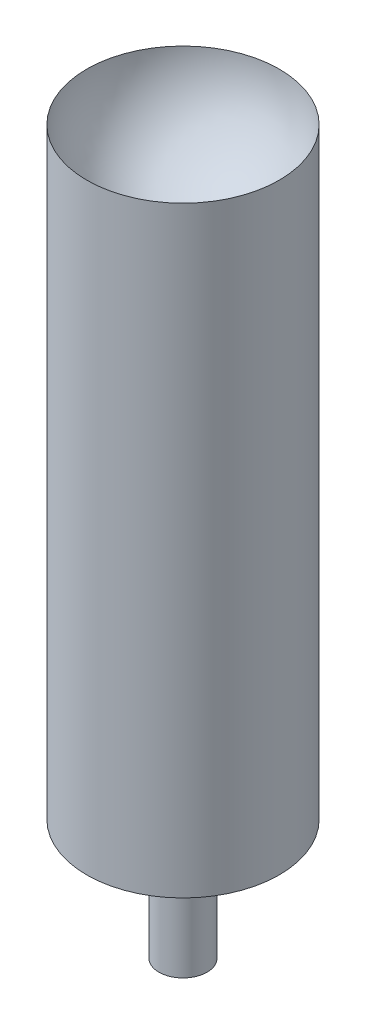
ISO-10303-21;
HEADER;
FILE_DESCRIPTION(('STEP AP214'),'2;1');
FILE_NAME('part.step','',(''),(''),'','','');
FILE_SCHEMA(('AUTOMOTIVE_DESIGN { 1 0 10303 214 1 1 1 1 }'));
ENDSEC;
DATA;
#1=APPLICATION_CONTEXT('core data for automotive mechanical design processes');
#2=APPLICATION_PROTOCOL_DEFINITION('international standard','automotive_design',2000,#1);
#3=PRODUCT_CONTEXT('',#1,'mechanical');
#4=PRODUCT('Part','Part','',(#3));
#5=PRODUCT_RELATED_PRODUCT_CATEGORY('part','',(#4));
#6=PRODUCT_DEFINITION_FORMATION('','',#4);
#7=PRODUCT_DEFINITION_CONTEXT('part definition',#1,'design');
#8=PRODUCT_DEFINITION('design','',#6,#7);
#9=PRODUCT_DEFINITION_SHAPE('','',#8);
#10=(LENGTH_UNIT() NAMED_UNIT(*) SI_UNIT(.MILLI.,.METRE.));
#11=(NAMED_UNIT(*) PLANE_ANGLE_UNIT() SI_UNIT($,.RADIAN.));
#12=(NAMED_UNIT(*) SI_UNIT($,.STERADIAN.) SOLID_ANGLE_UNIT());
#13=UNCERTAINTY_MEASURE_WITH_UNIT(LENGTH_MEASURE(1.E-05),#10,'distance_accuracy_value','');
#14=(GEOMETRIC_REPRESENTATION_CONTEXT(3) GLOBAL_UNCERTAINTY_ASSIGNED_CONTEXT((#13)) GLOBAL_UNIT_ASSIGNED_CONTEXT((#10,
#11,#12)) REPRESENTATION_CONTEXT('',''));
#15=CARTESIAN_POINT('',(0.,0.,0.));
#16=DIRECTION('',(0.,0.,1.));
#17=DIRECTION('',(1.,0.,0.));
#18=AXIS2_PLACEMENT_3D('',#15,#16,#17);
#19=CARTESIAN_POINT('',(0.,0.,0.));
#20=DIRECTION('',(0.,-1.,0.));
#21=DIRECTION('',(0.,0.,-1.));
#22=AXIS2_PLACEMENT_3D('',#19,#20,#21);
#23=PLANE('',#22);
#24=CARTESIAN_POINT('',(0.,0.,0.));
#25=DIRECTION('',(0.,-1.,0.));
#26=DIRECTION('',(0.,0.,-1.));
#27=AXIS2_PLACEMENT_3D('',#24,#25,#26);
#28=CIRCLE('',#27,2.);
#29=CARTESIAN_POINT('',(0.,0.,-2.));
#30=VERTEX_POINT('',#29);
#31=EDGE_CURVE('E10',#30,#30,#28,.T.);
#32=ORIENTED_EDGE('',*,*,#31,.T.);
#33=EDGE_LOOP('',(#32));
#34=FACE_BOUND('',#33,.T.);
#35=ADVANCED_FACE('F37',(#34),#23,.T.);
#36=CARTESIAN_POINT('',(0.,0.,0.));
#37=DIRECTION('',(0.,-1.,0.));
#38=DIRECTION('',(0.,0.,-1.));
#39=AXIS2_PLACEMENT_3D('',#36,#37,#38);
#40=CYLINDRICAL_SURFACE('',#39,2.);
#41=CARTESIAN_POINT('',(0.,10.,0.));
#42=DIRECTION('',(0.,-1.,0.));
#43=DIRECTION('',(0.,0.,-1.));
#44=AXIS2_PLACEMENT_3D('',#41,#42,#43);
#45=CIRCLE('',#44,2.);
#46=CARTESIAN_POINT('',(0.,10.,-2.));
#47=VERTEX_POINT('',#46);
#48=EDGE_CURVE('E44',#47,#47,#45,.T.);
#49=ORIENTED_EDGE('',*,*,#48,.T.);
#50=EDGE_LOOP('',(#49));
#51=FACE_BOUND('',#50,.T.);
#52=ORIENTED_EDGE('',*,*,#31,.F.);
#53=EDGE_LOOP('',(#52));
#54=FACE_BOUND('',#53,.T.);
#55=ADVANCED_FACE('F73',(#51,#54),#40,.T.);
#56=CARTESIAN_POINT('',(2.,10.,0.));
#57=DIRECTION('',(0.,-1.,0.));
#58=DIRECTION('',(0.,0.,-1.));
#59=AXIS2_PLACEMENT_3D('',#56,#57,#58);
#60=PLANE('',#59);
#61=CARTESIAN_POINT('',(0.,10.,0.));
#62=DIRECTION('',(0.,-1.,0.));
#63=DIRECTION('',(0.,0.,-1.));
#64=AXIS2_PLACEMENT_3D('',#61,#62,#63);
#65=CIRCLE('',#64,8.);
#66=CARTESIAN_POINT('',(0.,10.,-8.));
#67=VERTEX_POINT('',#66);
#68=EDGE_CURVE('E49',#67,#67,#65,.T.);
#69=ORIENTED_EDGE('',*,*,#68,.T.);
#70=EDGE_LOOP('',(#69));
#71=FACE_BOUND('',#70,.T.);
#72=ORIENTED_EDGE('',*,*,#48,.F.);
#73=EDGE_LOOP('',(#72));
#74=FACE_BOUND('',#73,.T.);
#75=ADVANCED_FACE('F70',(#71,#74),#60,.T.);
#76=CARTESIAN_POINT('',(0.,0.,0.));
#77=DIRECTION('',(0.,-1.,0.));
#78=DIRECTION('',(0.,0.,-1.));
#79=AXIS2_PLACEMENT_3D('',#76,#77,#78);
#80=CYLINDRICAL_SURFACE('',#79,8.);
#81=CARTESIAN_POINT('',(0.,60.,0.));
#82=DIRECTION('',(0.,-1.,0.));
#83=DIRECTION('',(0.,0.,-1.));
#84=AXIS2_PLACEMENT_3D('',#81,#82,#83);
#85=CIRCLE('',#84,8.);
#86=CARTESIAN_POINT('',(0.,60.,-8.));
#87=VERTEX_POINT('',#86);
#88=EDGE_CURVE('E54',#87,#87,#85,.T.);
#89=ORIENTED_EDGE('',*,*,#88,.T.);
#90=EDGE_LOOP('',(#89));
#91=FACE_BOUND('',#90,.T.);
#92=ORIENTED_EDGE('',*,*,#68,.F.);
#93=EDGE_LOOP('',(#92));
#94=FACE_BOUND('',#93,.T.);
#95=ADVANCED_FACE('F61',(#91,#94),#80,.T.);
#96=CARTESIAN_POINT('',(0.,60.,0.));
#97=DIRECTION('',(0.,-1.,0.));
#98=DIRECTION('',(1.,0.,0.));
#99=AXIS2_PLACEMENT_3D('',#96,#97,#98);
#100=SPHERICAL_SURFACE('',#99,8.);
#101=ORIENTED_EDGE('',*,*,#88,.F.);
#102=EDGE_LOOP('',(#101));
#103=FACE_BOUND('',#102,.T.);
#104=ADVANCED_FACE('F64',(#103),#100,.F.);
#105=CLOSED_SHELL('',(#35,#55,#75,#95,#104));
#106=MANIFOLD_SOLID_BREP('B2',#105);
#107=ADVANCED_BREP_SHAPE_REPRESENTATION('',(#18,#106),#14);
#108=SHAPE_DEFINITION_REPRESENTATION(#9,#107);
ENDSEC;
END-ISO-10303-21;
